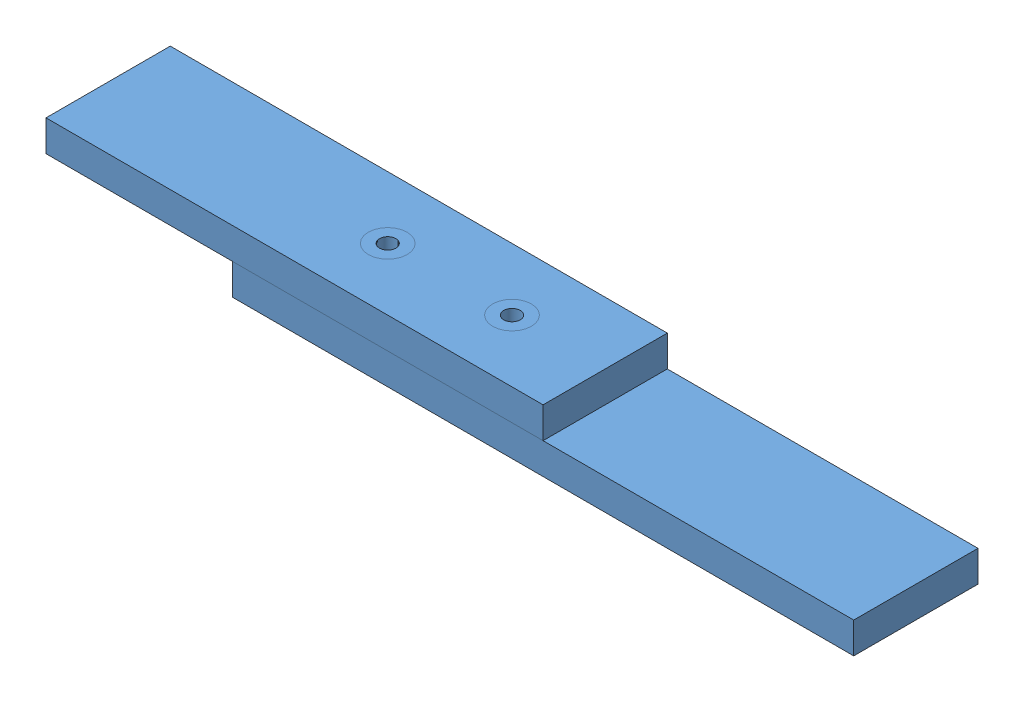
SolidWorks assembly Bolt Assy.SLDASM, configuration Default (file format 3400). Lengths in mm.
Overall size (330.2 25.4 50.8).
10 component instances, 4 part files, 19 mates.
Components (placement in the parent):
- Bar1-1: Bar1.SLDPRT [Clearance] at origin size (203.2 12.7 50.8)
- Bar1-3: Bar1.SLDPRT [long bar] at (330.2 -12.7 0) x (-1 0 0) z (0 0 -1) size (254 12.7 50.8)
- Hex Bolt_AI-7: Hex Bolt_AI.SLDPRT [HBOLT 0.2500-28x1.5x0.75-N] at (165.1 19.1262 0) x (0 -1 0) z (0 0 1) (suppressed, hidden)
- Hex Bolt_AI-8: Hex Bolt_AI.SLDPRT [HBOLT 0.2500-28x1.5x0.75-N] at (114.3 19.1262 0) x (0 -1 0) z (0 0 1) (suppressed, hidden)
- Flat Washer Type A Narrow_AI-9: Flat Washer Type A Narrow_AI.sldprt [FW 0.25] at (165.1 12.7 0) x (0 -1 0) z (0 0 1) (suppressed, hidden)
- Flat Washer Type A Narrow_AI-10: Flat Washer Type A Narrow_AI.sldprt [FW 0.25] at (114.3 12.7 0) x (0 -1 0) z (0 0 1) (suppressed, hidden)
- Flat Washer Type A Narrow_AI-11: Flat Washer Type A Narrow_AI.sldprt [FW 0.25] at (165.1 -12.7 0) x (0 1 0) z (0 0 1) (suppressed, hidden)
- Hex Nut_AI-5: Hex Nut_AI.sldprt [HNUT 0.3125-18-D-N] at (165.1 -21.2852 0) x (1 0 0) z (0 -1 0) (suppressed, hidden)
- Flat Washer Type A Narrow_AI-12: Flat Washer Type A Narrow_AI.sldprt [FW 0.25] at (114.3 -12.7 0) x (0 1 0) z (0 0 1) (suppressed, hidden)
- Hex Nut_AI-6: Hex Nut_AI.sldprt [HNUT 0.3125-18-D-N] at (114.3 -21.2852 0) x (1 0 0) z (0 -1 0) (suppressed, hidden)
Mates (geometry in assembly coordinates):
- Concentric3: concentric aligned: cylinder of ?; cylinder of ?
- Concentric4: concentric aligned: cylinder of ?; cylinder of ?
- Coincident2: coincident anti-aligned: plane of ?; plane of ?
- Concentric33: concentric aligned: cylinder of ?; cylinder of ?
- Coincident32: coincident anti-aligned: plane of ?; plane of ?
- Concentric341: concentric aligned: cylinder of ?; cylinder of ?
- Coincident331: coincident anti-aligned: plane of ?; plane of ?
- Concentric35: concentric aligned: cylinder of ?; cylinder of ?
- Coincident34: coincident anti-aligned: plane of ?; plane of ?
- Concentric361: concentric aligned: cylinder of ?; cylinder of ?
- Coincident351: coincident anti-aligned: plane of ?; plane of ?
- Concentric37: concentric anti-aligned: cylinder of ?; cylinder of ?
- Coincident36: coincident anti-aligned: plane of ?; plane of ?
- Concentric38: concentric anti-aligned: cylinder of ?; cylinder of ?
- Coincident37: coincident anti-aligned: plane of ?; plane of ?
- Concentric39: concentric anti-aligned: cylinder of ?; cylinder of ?
- Coincident38: coincident anti-aligned: plane of ?; plane of ?
- Concentric40: concentric anti-aligned: cylinder of ?; cylinder of ?
- Coincident39: coincident anti-aligned: 
